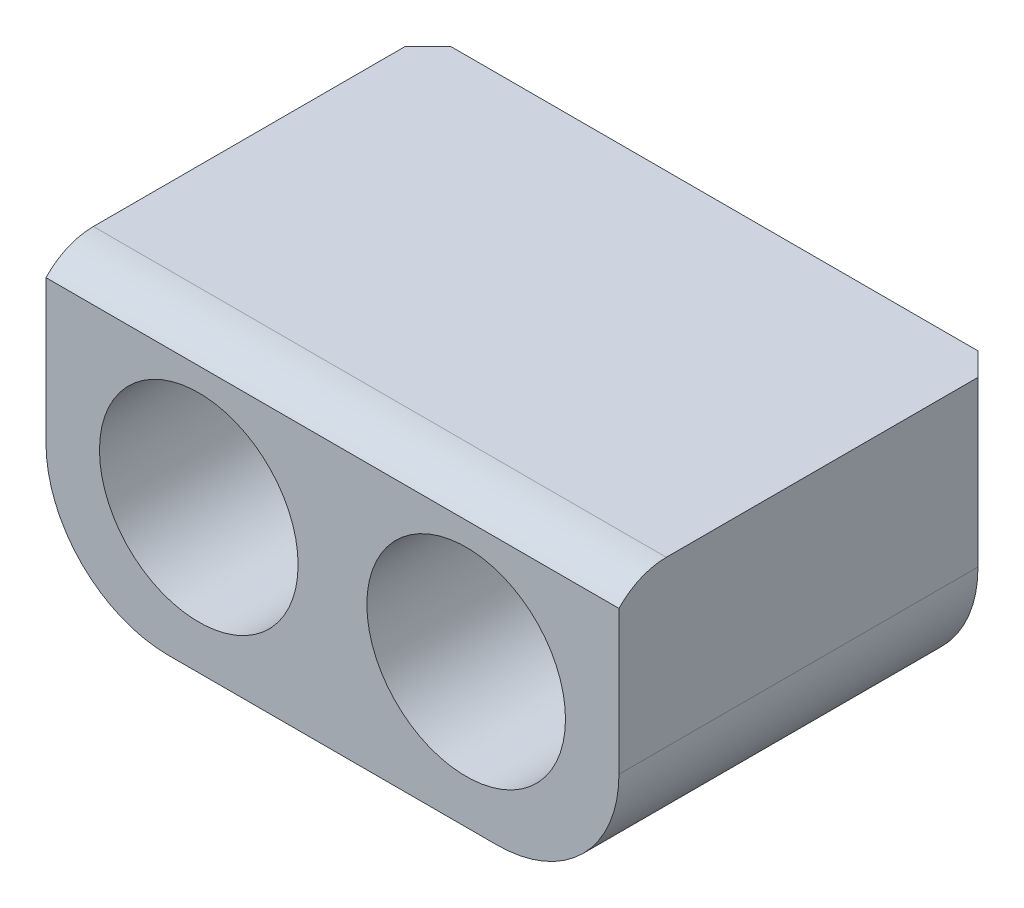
from build123d import *

# Parameters (mm, degrees)
SKETCH3_W             = 19.05
SKETCH3_H             = 9.525
EXTRUDE1_DEPTH        = 12.7
FILLET1_R             = 4.064
F_6_CBORE_D           = 4.318
F_6_CBORE_CBORE_D     = 6.604
F_6_CBORE_CBORE_DEPTH = 4.826
CUT_EXTRUDE1_DEPTH    = 25.797542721
CHAMFER1_SIZE         = 0.762


with BuildPart() as part:
    # Sketch3 → Extrude1 (new body)
    with BuildSketch(Plane.XY):
        with Locations((9.525, -4.7625)):
            Rectangle(SKETCH3_W, SKETCH3_H)
    extrude(amount=-EXTRUDE1_DEPTH)

    # Fillet1
    fillet1_edges = [part.edges().sort_by_distance(p)[0] for p in [
        (19.05, -9.525, -6.35),
        (0, -9.525, -6.35),
    ]]
    fillet(fillet1_edges, radius=FILLET1_R)

    # 6 CBORE (through all)
    with Locations(Plane.XY):
        with Locations((5.08, -4.7625), (13.97, -4.7625)):
            CounterBoreHole(F_6_CBORE_D / 2, F_6_CBORE_CBORE_D / 2, F_6_CBORE_CBORE_DEPTH)

    # Sketch6 → Cut-Extrude1 (cut, through all)
    with BuildSketch(Plane.ZY):
        with BuildLine():
            Line((0, -0.685077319), (0.9652, -0.685077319))
            Line((0.9652, -0.685077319), (0.9652, 0.584922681))
            Line((0.9652, 0.584922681), (-1.5748, 0.584922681))
            Line((-1.5748, 0.584922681), (-1.5748, 0))
            ThreePointArc((-1.5748, 0), (-0.716119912, -0.178685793), (0, -0.685077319))
        make_face()
    extrude(amount=-CUT_EXTRUDE1_DEPTH, mode=Mode.SUBTRACT)

    # Chamfer1
    chamfer1_edges = [part.edges().sort_by_distance(p)[0] for p in [
        (9.525, -9.525, -12.7),
        (19.05, -2.7305, -12.7),
        (17.859681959, -8.334681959, -12.7),
        (1.190318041, -8.334681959, -12.7),
        (0, -2.7305, -12.7),
    ]]
    chamfer(chamfer1_edges, length=CHAMFER1_SIZE)


solid = part.part
